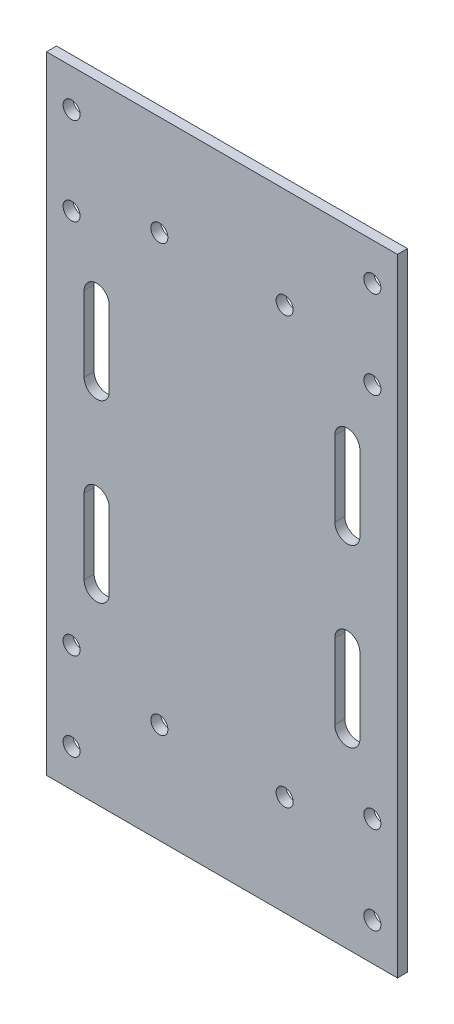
from build123d import *

# Parameters (mm, degrees)
SKETCH1_W                   = 70
SKETCH1_H                   = 125
BOSS_EXTRUDE1_DEPTH         = 2
LO_XUYEN_M3_D3_4_DEPTH      = 72.660658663
LO_XUYEN_M3_D3_4_DEPTH_BACK = 72.660658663
SKETCH2_R                   = 1.7
THAN_RANH_DEPTH             = 72.660658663
THAN_RANH_DEPTH_BACK        = 72.660658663
SKETCH3_W                   = 5
SKETCH3_H                   = 15
DAU_RANH_R2_5_DEPTH         = 72.660658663
DAU_RANH_R2_5_DEPTH_BACK    = 72.660658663
SKETCH4_R                   = 2.5


with BuildPart() as part:
    # Sketch1 → Boss-Extrude1 (new body)
    with BuildSketch(Plane.XY):
        Rectangle(SKETCH1_W, SKETCH1_H)
    extrude(amount=-BOSS_EXTRUDE1_DEPTH)

    # Sketch2 → Lo_xuyen_M3_D3_4 (cut, two sides: drawn at the far end of the back side and taken through both)
    with BuildSketch(Plane.XY.offset(-LO_XUYEN_M3_D3_4_DEPTH_BACK)):
        with Locations((-30, -55)):
            Circle(SKETCH2_R)
        with Locations((-30, -37.5)):
            Circle(SKETCH2_R)
        with Locations((-30, 37.5)):
            Circle(SKETCH2_R)
        with Locations((-30, 55)):
            Circle(SKETCH2_R)
        with Locations((30, -55)):
            Circle(SKETCH2_R)
        with Locations((30, -37.5)):
            Circle(SKETCH2_R)
        with Locations((30, 37.5)):
            Circle(SKETCH2_R)
        with Locations((30, 55)):
            Circle(SKETCH2_R)
        with Locations((-12.5, -42.5)):
            Circle(SKETCH2_R)
        with Locations((-12.5, 42.5)):
            Circle(SKETCH2_R)
        with Locations((12.5, -42.5)):
            Circle(SKETCH2_R)
        with Locations((12.5, 42.5)):
            Circle(SKETCH2_R)
    extrude(amount=LO_XUYEN_M3_D3_4_DEPTH + LO_XUYEN_M3_D3_4_DEPTH_BACK, mode=Mode.SUBTRACT)

    # Sketch3 → Than_ranh (cut, two sides: drawn at the far end of the back side and taken through both)
    with BuildSketch(Plane.XY.offset(-THAN_RANH_DEPTH_BACK)):
        with Locations((-25, -17.5)):
            Rectangle(SKETCH3_W, SKETCH3_H)
        with Locations((-25, 17.5)):
            Rectangle(SKETCH3_W, SKETCH3_H)
        with Locations((25, -17.5)):
            Rectangle(SKETCH3_W, SKETCH3_H)
        with Locations((25, 17.5)):
            Rectangle(SKETCH3_W, SKETCH3_H)
    extrude(amount=THAN_RANH_DEPTH + THAN_RANH_DEPTH_BACK, mode=Mode.SUBTRACT)

    # Sketch4 → Dau_ranh_R2_5 (cut, two sides: drawn at the far end of the back side and taken through both)
    with BuildSketch(Plane.XY.offset(-DAU_RANH_R2_5_DEPTH_BACK)):
        with Locations((-25, -25)):
            Circle(SKETCH4_R)
        with Locations((-25, -10)):
            Circle(SKETCH4_R)
        with Locations((-25, 10)):
            Circle(SKETCH4_R)
        with Locations((-25, 25)):
            Circle(SKETCH4_R)
        with Locations((25, -25)):
            Circle(SKETCH4_R)
        with Locations((25, -10)):
            Circle(SKETCH4_R)
        with Locations((25, 10)):
            Circle(SKETCH4_R)
        with Locations((25, 25)):
            Circle(SKETCH4_R)
    extrude(amount=DAU_RANH_R2_5_DEPTH + DAU_RANH_R2_5_DEPTH_BACK, mode=Mode.SUBTRACT)


solid = part.part
